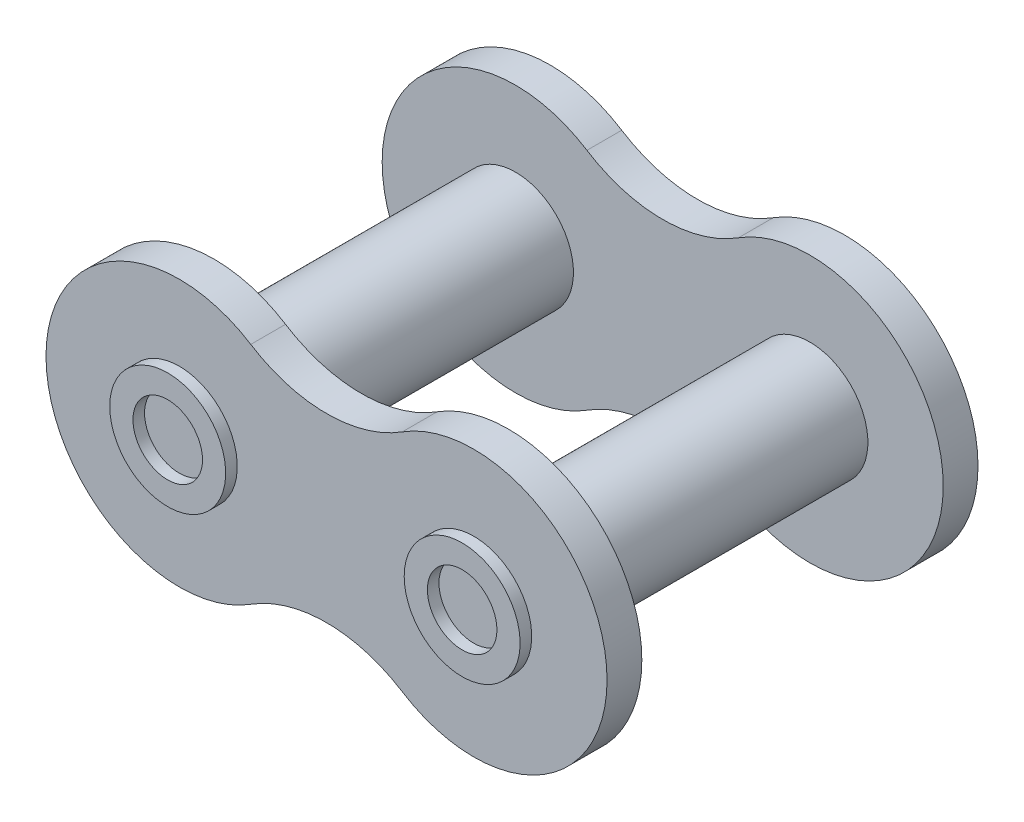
from build123d import *

# Parameters (mm, degrees)
SKETCH1_R                = 2.5
BOSS_EXTRUDE3_DEPTH      = 6.5
BOSS_EXTRUDE3_2_DEPTH    = 6.5
BOSS_EXTRUDE7_START      = -6.5
BOSS_EXTRUDE7_DEPTH      = 1.5
BOSS_EXTRUDE8_DEPTH      = 8.5
BOSS_EXTRUDE8_DEPTH_BACK = 8.5
SKETCH2_R                = 2.5
SKETCH3_R                = 1.5
CUT_EXTRUDE1_DEPTH       = 0.5
CUT_EXTRUDE2_START       = -0.5
SKETCH4_R                = 1.5
CUT_EXTRUDE2_DEPTH       = 0.5


with BuildPart() as part:
    # Sketch1 → Boss-Extrude3 (new, symmetric)
    with BuildSketch(Plane.XY):
        with Locations(Location((6.35, 0, 0), (0, 0, 180))):
            Circle(SKETCH1_R)
    extrude(amount=BOSS_EXTRUDE3_DEPTH, both=True)



with BuildPart() as body_2:
    # Sketch1 → Boss-Extrude3 2 (new, symmetric)
    with BuildSketch(Plane.XY):
        with Locations(Location((-6.35, 0, 0), (0, 0, 180))):
            Circle(SKETCH1_R)
    extrude(amount=BOSS_EXTRUDE3_2_DEPTH, both=True)


with BuildPart() as part_1:
    add(part.part)

    add(body_2.part)  # Boss-Extrude7 merges body 2
    # Sketch1_5 → Boss-Extrude7 (add)
    with BuildSketch(Plane.XY.offset(BOSS_EXTRUDE7_START)):
        with BuildLine():
            ThreePointArc((-3.267678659, 4.854049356), (-12.1, 0), (-3.267678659, -4.854049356))
            ThreePointArc((-3.267678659, -4.854049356), (0, -3.904220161), (3.267678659, -4.854049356))
            ThreePointArc((3.267678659, -4.854049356), (12.1, 0), (3.267678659, 4.854049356))
            ThreePointArc((3.267678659, 4.854049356), (0, 3.904220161), (-3.267678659, 4.854049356))
        make_face()
    boss_extrude7 = extrude(amount=-BOSS_EXTRUDE7_DEPTH)

    # Mirror1: Boss-Extrude7 across plane
    add(boss_extrude7.mirror(Plane.XY))

    # Sketch2 → Boss-Extrude8 (add, two sides: drawn at the far end of the back side and taken through both)
    with BuildSketch(Plane.XY.offset(-BOSS_EXTRUDE8_DEPTH_BACK)):
        with Locations(Location((-6.35, 0, 0), (0, 0, 180))):
            Circle(SKETCH2_R)
        with Locations(Location((6.35, 0, 0), (0, 0, 180))):
            Circle(SKETCH2_R)
    extrude(amount=BOSS_EXTRUDE8_DEPTH + BOSS_EXTRUDE8_DEPTH_BACK)

    # Sketch3 → Cut-Extrude1 (cut)
    with BuildSketch(Plane.XY.offset(8.5)):
        with Locations((-6.35, 0)):
            Circle(SKETCH3_R)
        with Locations((6.35, 0)):
            Circle(SKETCH3_R)
    extrude(amount=-CUT_EXTRUDE1_DEPTH, mode=Mode.SUBTRACT)

    # Sketch4 → Cut-Extrude2 (cut)
    with BuildSketch(Plane(origin=(0, 0, -8.5), x_dir=(-1, 0, 0), z_dir=(0, 0, -1)).offset(CUT_EXTRUDE2_START)):
        with Locations(Location((6.35, 0, 0), (0, 0, 180))):
            Circle(SKETCH4_R)
        with Locations(Location((-6.35, 0, 0), (0, 0, 180))):
            Circle(SKETCH4_R)
    extrude(amount=CUT_EXTRUDE2_DEPTH, mode=Mode.SUBTRACT)


solid = part_1.part
